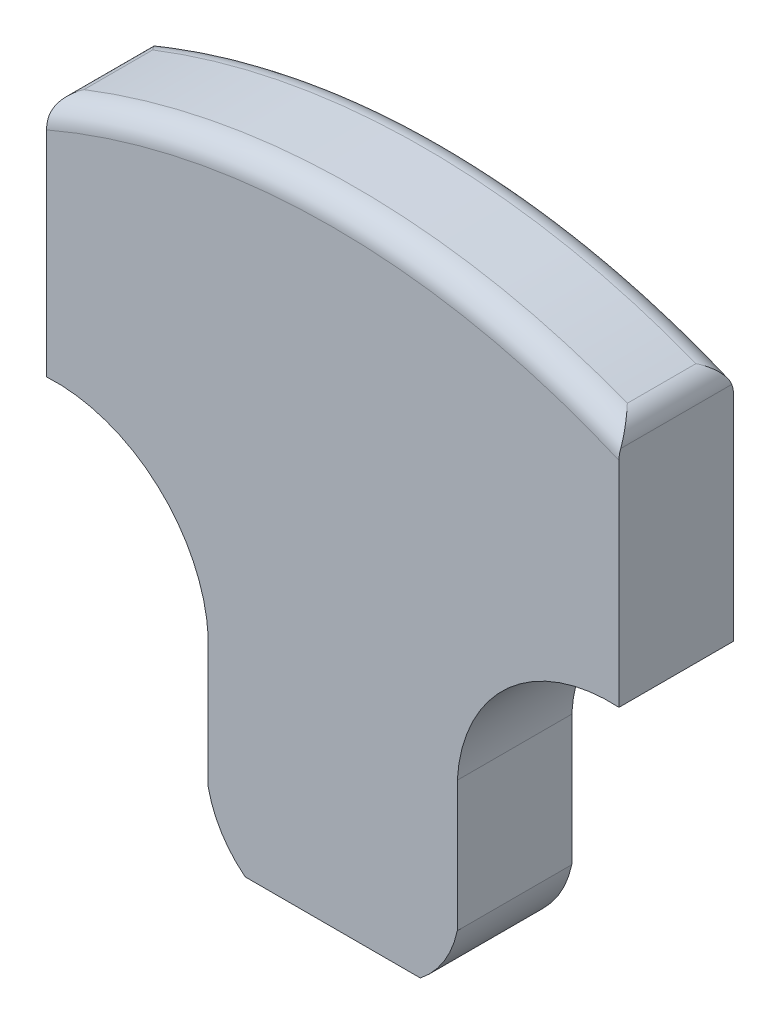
from build123d import *

# Parameters (mm, degrees)
EXTRUDE1_DEPTH     = 12.7
FILLET1_R          = 2.54
CUT_EXTRUDE1_DEPTH = 56.919751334


with BuildPart() as part:
    # Sketch1 → Extrude1 (new body)
    with BuildSketch(Plane.XY):
        with BuildLine():
            Line((-39.887203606, 30.754761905), (-39.887203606, -32.745238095))
            Line((-39.887203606, -32.745238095), (23.612796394, -32.745238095))
            Line((23.612796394, -32.745238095), (23.612796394, 30.754761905))
            ThreePointArc((23.612796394, 30.754761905), (-8.137203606, 37.077480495), (-39.887203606, 30.754761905))
        make_face()
    extrude(amount=EXTRUDE1_DEPTH)

    # Fillet1
    fillet1_edges = [part.edges().sort_by_distance(p)[0] for p in [
        (-8.137203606, 37.077480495, 12.7),
        (-8.137203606, 37.077480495, 0),
        (23.612796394, 30.754761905, 6.35),
        (-39.887203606, 30.754761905, 6.35),
    ]]
    fillet(fillet1_edges, radius=FILLET1_R)

    # Sketch2 → Cut-Extrude1 (cut, through all)
    with BuildSketch(Plane.XY.offset(12.7)):
        with BuildLine():
            Line((-21.948527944, -26.157883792), (-21.948527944, -11.699153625))
            ThreePointArc((-21.948527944, -11.699153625), (-27.61050639, 0.000739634), (-39.887203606, 4.270190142))
            Line((-39.887203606, 4.270190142), (-39.887203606, -32.745238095))
            Line((-39.887203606, -32.745238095), (-17.848291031, -32.745238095))
            ThreePointArc((-17.848291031, -32.745238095), (-20.480672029, -29.813984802), (-21.948527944, -26.157883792))
        make_face()
        with BuildLine():
            ThreePointArc((5.674120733, -26.157883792), (4.206264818, -29.813984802), (1.57388382, -32.745238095))
            Line((1.57388382, -32.745238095), (23.612796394, -32.745238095))
            Line((23.612796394, -32.745238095), (23.612796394, 4.270190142))
            ThreePointArc((23.612796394, 4.270190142), (11.336099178, 0.000739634), (5.674120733, -11.699153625))
            Line((5.674120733, -11.699153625), (5.674120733, -26.157883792))
        make_face()
    extrude(amount=-CUT_EXTRUDE1_DEPTH, mode=Mode.SUBTRACT)


solid = part.part
